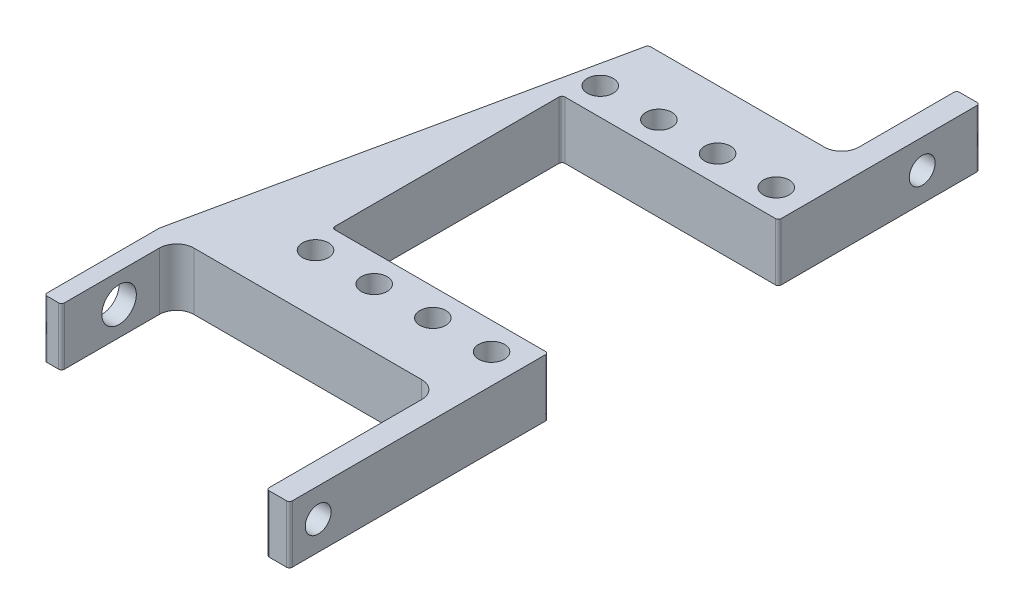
from build123d import *

# Parameters (mm, degrees)
BOSS_EXTRUDE1_DEPTH      = 10
SKETCH4_R                = 2.25
CUT_EXTRUDE2_DEPTH       = 26
LPATTERN2_COUNT          = 22
LPATTERN2_PITCH          = 10.2
SKETCH5_W                = 12
SKETCH5_H                = 10
BOSS_EXTRUDE2_DEPTH      = 30
SKETCH6_W                = 12
SKETCH6_H                = 10
BOSS_EXTRUDE3_DEPTH      = 20
SKETCH7_R                = 2.25
CUT_EXTRUDE3_DEPTH       = 20
SKETCH10_R               = 2.25
CUT_EXTRUDE4_DEPTH       = 20
MIRROR1_COPY_1_SKETCH_R  = 2.25
MIRROR1_COPY_1_DEPTH     = 26
MIRROR1_COPY_2_SKETCH_R  = 2.25
MIRROR1_COPY_2_DEPTH     = 26
MIRROR1_COPY_3_SKETCH_R  = 2.25
MIRROR1_COPY_3_DEPTH     = 26
MIRROR1_COPY_4_SKETCH_R  = 2.25
MIRROR1_COPY_4_DEPTH     = 26
MIRROR1_COPY_5_SKETCH_R  = 2.25
MIRROR1_COPY_5_DEPTH     = 26
MIRROR1_COPY_6_SKETCH_R  = 2.25
MIRROR1_COPY_6_DEPTH     = 26
MIRROR1_COPY_7_SKETCH_R  = 2.25
MIRROR1_COPY_7_DEPTH     = 26
MIRROR1_COPY_8_SKETCH_R  = 2.25
MIRROR1_COPY_8_DEPTH     = 26
MIRROR1_COPY_9_SKETCH_R  = 2.25
MIRROR1_COPY_9_DEPTH     = 26
MIRROR1_COPY_10_SKETCH_R = 2.25
MIRROR1_COPY_10_DEPTH    = 26
MIRROR1_COPY_11_SKETCH_R = 2.25
MIRROR1_COPY_11_DEPTH    = 26
MIRROR1_COPY_12_SKETCH_R = 2.25
MIRROR1_COPY_12_DEPTH    = 26
MIRROR1_COPY_13_SKETCH_R = 2.25
MIRROR1_COPY_13_DEPTH    = 26
MIRROR1_COPY_14_SKETCH_R = 2.25
MIRROR1_COPY_14_DEPTH    = 26
MIRROR1_COPY_15_SKETCH_R = 2.25
MIRROR1_COPY_15_DEPTH    = 26
MIRROR1_COPY_16_SKETCH_R = 2.25
MIRROR1_COPY_16_DEPTH    = 26
MIRROR1_COPY_17_SKETCH_R = 2.25
MIRROR1_COPY_17_DEPTH    = 26
MIRROR1_COPY_18_SKETCH_R = 2.25
MIRROR1_COPY_18_DEPTH    = 26
MIRROR1_COPY_19_SKETCH_R = 2.25
MIRROR1_COPY_19_DEPTH    = 26
MIRROR1_COPY_20_SKETCH_R = 2.25
MIRROR1_COPY_20_DEPTH    = 26
MIRROR1_COPY_21_SKETCH_R = 2.25
MIRROR1_COPY_21_DEPTH    = 26
SKETCH11_W               = 20
SKETCH11_H               = 10
CUT_EXTRUDE5_DEPTH       = 12
SKETCH12_R               = 3
CUT_EXTRUDE6_DEPTH       = 12
SKETCH13_W               = 20
SKETCH13_H               = 10
CUT_EXTRUDE7_DEPTH       = 8
SKETCH14_W               = 30
SKETCH14_H               = 10
CUT_EXTRUDE8_DEPTH       = 8
FILLET1_R                = 3
FILLET2_R                = 0.5


with BuildPart() as part:
    # Sketch2 → Boss-Extrude1 (new body)
    with BuildSketch(Plane(origin=(0, 0, 0), x_dir=(1, 0, 0), z_dir=(0, 1, 0))):
        Polygon((0, 0), (0, 20), (14.994375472, 90.002119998), (52.614375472, 90.002119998), (52.614375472, 75), (15, 75), (15, 35), (52.614375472, 35), (52.614375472, 20), (15, 20), (15, 0), align=None)
    extrude(amount=BOSS_EXTRUDE1_DEPTH)

    # Sketch4 → Cut-Extrude2 (cut)
    with BuildSketch(Plane(origin=(0, 10, 0), x_dir=(1, 0, 0), z_dir=(0, 1, 0))):
        with Locations(Location((16.9, 30.25, 0), (0, 0, 270))):
            Circle(SKETCH4_R)
    cut_extrude2 = extrude(amount=-CUT_EXTRUDE2_DEPTH, mode=Mode.SUBTRACT)

    # LPattern2: Cut-Extrude2 ×22
    with Locations(*[(i * LPATTERN2_PITCH, 0, 0) for i in range(1, LPATTERN2_COUNT)]):
        add(cut_extrude2, mode=Mode.SUBTRACT)

    # Sketch5 → Boss-Extrude2 (add)
    with BuildSketch(Plane.XY.offset(-20)):
        with Locations((46.614375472, 5)):
            Rectangle(SKETCH5_W, SKETCH5_H)
    extrude(amount=BOSS_EXTRUDE2_DEPTH)

    # Sketch6 → Boss-Extrude3 (add)
    with BuildSketch(Plane(origin=(0, 0, -90.002119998), x_dir=(-1, 0, 0), z_dir=(0, 0, -1))):
        with Locations((-46.614375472, 5)):
            Rectangle(SKETCH6_W, SKETCH6_H)
    extrude(amount=BOSS_EXTRUDE3_DEPTH)

    # Sketch7 → Cut-Extrude3 (cut)
    with BuildSketch(Plane.ZY.offset(-40.614375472)):
        with Locations((-100.002119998, 5)):
            Circle(SKETCH7_R)
    extrude(amount=-CUT_EXTRUDE3_DEPTH, mode=Mode.SUBTRACT)

    # Sketch10 → Cut-Extrude4 (cut)
    with BuildSketch(Plane.ZY.offset(-40.614375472)):
        with Locations((5, 5)):
            Circle(SKETCH10_R)
    extrude(amount=-CUT_EXTRUDE4_DEPTH, mode=Mode.SUBTRACT)

    # Mirror1: Cut-Extrude2 across plane
    add(cut_extrude2.mirror(Plane.XY.offset(-55)), mode=Mode.SUBTRACT)

    # Mirror1 copy 1 sketch → Mirror1 copy 1 (cut)
    with BuildSketch(Plane(origin=(10.2, 10, -110), x_dir=(1, 0, 0), z_dir=(0, 1, 0))):
        with Locations((16.9, -30.25)):
            Circle(MIRROR1_COPY_1_SKETCH_R)
    extrude(amount=-MIRROR1_COPY_1_DEPTH, mode=Mode.SUBTRACT)

    # Mirror1 copy 2 sketch → Mirror1 copy 2 (cut)
    with BuildSketch(Plane(origin=(20.4, 10, -110), x_dir=(1, 0, 0), z_dir=(0, 1, 0))):
        with Locations((16.9, -30.25)):
            Circle(MIRROR1_COPY_2_SKETCH_R)
    extrude(amount=-MIRROR1_COPY_2_DEPTH, mode=Mode.SUBTRACT)

    # Mirror1 copy 3 sketch → Mirror1 copy 3 (cut)
    with BuildSketch(Plane(origin=(30.6, 10, -110), x_dir=(1, 0, 0), z_dir=(0, 1, 0))):
        with Locations((16.9, -30.25)):
            Circle(MIRROR1_COPY_3_SKETCH_R)
    extrude(amount=-MIRROR1_COPY_3_DEPTH, mode=Mode.SUBTRACT)

    # Mirror1 copy 4 sketch → Mirror1 copy 4 (cut)
    with BuildSketch(Plane(origin=(40.8, 10, -110), x_dir=(1, 0, 0), z_dir=(0, 1, 0))):
        with Locations((16.9, -30.25)):
            Circle(MIRROR1_COPY_4_SKETCH_R)
    extrude(amount=-MIRROR1_COPY_4_DEPTH, mode=Mode.SUBTRACT)

    # Mirror1 copy 5 sketch → Mirror1 copy 5 (cut)
    with BuildSketch(Plane(origin=(51, 10, -110), x_dir=(1, 0, 0), z_dir=(0, 1, 0))):
        with Locations((16.9, -30.25)):
            Circle(MIRROR1_COPY_5_SKETCH_R)
    extrude(amount=-MIRROR1_COPY_5_DEPTH, mode=Mode.SUBTRACT)

    # Mirror1 copy 6 sketch → Mirror1 copy 6 (cut)
    with BuildSketch(Plane(origin=(61.2, 10, -110), x_dir=(1, 0, 0), z_dir=(0, 1, 0))):
        with Locations((16.9, -30.25)):
            Circle(MIRROR1_COPY_6_SKETCH_R)
    extrude(amount=-MIRROR1_COPY_6_DEPTH, mode=Mode.SUBTRACT)

    # Mirror1 copy 7 sketch → Mirror1 copy 7 (cut)
    with BuildSketch(Plane(origin=(71.4, 10, -110), x_dir=(1, 0, 0), z_dir=(0, 1, 0))):
        with Locations((16.9, -30.25)):
            Circle(MIRROR1_COPY_7_SKETCH_R)
    extrude(amount=-MIRROR1_COPY_7_DEPTH, mode=Mode.SUBTRACT)

    # Mirror1 copy 8 sketch → Mirror1 copy 8 (cut)
    with BuildSketch(Plane(origin=(81.6, 10, -110), x_dir=(1, 0, 0), z_dir=(0, 1, 0))):
        with Locations((16.9, -30.25)):
            Circle(MIRROR1_COPY_8_SKETCH_R)
    extrude(amount=-MIRROR1_COPY_8_DEPTH, mode=Mode.SUBTRACT)

    # Mirror1 copy 9 sketch → Mirror1 copy 9 (cut)
    with BuildSketch(Plane(origin=(91.8, 10, -110), x_dir=(1, 0, 0), z_dir=(0, 1, 0))):
        with Locations((16.9, -30.25)):
            Circle(MIRROR1_COPY_9_SKETCH_R)
    extrude(amount=-MIRROR1_COPY_9_DEPTH, mode=Mode.SUBTRACT)

    # Mirror1 copy 10 sketch → Mirror1 copy 10 (cut)
    with BuildSketch(Plane(origin=(102, 10, -110), x_dir=(1, 0, 0), z_dir=(0, 1, 0))):
        with Locations((16.9, -30.25)):
            Circle(MIRROR1_COPY_10_SKETCH_R)
    extrude(amount=-MIRROR1_COPY_10_DEPTH, mode=Mode.SUBTRACT)

    # Mirror1 copy 11 sketch → Mirror1 copy 11 (cut)
    with BuildSketch(Plane(origin=(112.2, 10, -110), x_dir=(1, 0, 0), z_dir=(0, 1, 0))):
        with Locations((16.9, -30.25)):
            Circle(MIRROR1_COPY_11_SKETCH_R)
    extrude(amount=-MIRROR1_COPY_11_DEPTH, mode=Mode.SUBTRACT)

    # Mirror1 copy 12 sketch → Mirror1 copy 12 (cut)
    with BuildSketch(Plane(origin=(122.4, 10, -110), x_dir=(1, 0, 0), z_dir=(0, 1, 0))):
        with Locations((16.9, -30.25)):
            Circle(MIRROR1_COPY_12_SKETCH_R)
    extrude(amount=-MIRROR1_COPY_12_DEPTH, mode=Mode.SUBTRACT)

    # Mirror1 copy 13 sketch → Mirror1 copy 13 (cut)
    with BuildSketch(Plane(origin=(132.6, 10, -110), x_dir=(1, 0, 0), z_dir=(0, 1, 0))):
        with Locations((16.9, -30.25)):
            Circle(MIRROR1_COPY_13_SKETCH_R)
    extrude(amount=-MIRROR1_COPY_13_DEPTH, mode=Mode.SUBTRACT)

    # Mirror1 copy 14 sketch → Mirror1 copy 14 (cut)
    with BuildSketch(Plane(origin=(142.8, 10, -110), x_dir=(1, 0, 0), z_dir=(0, 1, 0))):
        with Locations((16.9, -30.25)):
            Circle(MIRROR1_COPY_14_SKETCH_R)
    extrude(amount=-MIRROR1_COPY_14_DEPTH, mode=Mode.SUBTRACT)

    # Mirror1 copy 15 sketch → Mirror1 copy 15 (cut)
    with BuildSketch(Plane(origin=(153, 10, -110), x_dir=(1, 0, 0), z_dir=(0, 1, 0))):
        with Locations((16.9, -30.25)):
            Circle(MIRROR1_COPY_15_SKETCH_R)
    extrude(amount=-MIRROR1_COPY_15_DEPTH, mode=Mode.SUBTRACT)

    # Mirror1 copy 16 sketch → Mirror1 copy 16 (cut)
    with BuildSketch(Plane(origin=(163.2, 10, -110), x_dir=(1, 0, 0), z_dir=(0, 1, 0))):
        with Locations((16.9, -30.25)):
            Circle(MIRROR1_COPY_16_SKETCH_R)
    extrude(amount=-MIRROR1_COPY_16_DEPTH, mode=Mode.SUBTRACT)

    # Mirror1 copy 17 sketch → Mirror1 copy 17 (cut)
    with BuildSketch(Plane(origin=(173.4, 10, -110), x_dir=(1, 0, 0), z_dir=(0, 1, 0))):
        with Locations((16.9, -30.25)):
            Circle(MIRROR1_COPY_17_SKETCH_R)
    extrude(amount=-MIRROR1_COPY_17_DEPTH, mode=Mode.SUBTRACT)

    # Mirror1 copy 18 sketch → Mirror1 copy 18 (cut)
    with BuildSketch(Plane(origin=(183.6, 10, -110), x_dir=(1, 0, 0), z_dir=(0, 1, 0))):
        with Locations((16.9, -30.25)):
            Circle(MIRROR1_COPY_18_SKETCH_R)
    extrude(amount=-MIRROR1_COPY_18_DEPTH, mode=Mode.SUBTRACT)

    # Mirror1 copy 19 sketch → Mirror1 copy 19 (cut)
    with BuildSketch(Plane(origin=(193.8, 10, -110), x_dir=(1, 0, 0), z_dir=(0, 1, 0))):
        with Locations((16.9, -30.25)):
            Circle(MIRROR1_COPY_19_SKETCH_R)
    extrude(amount=-MIRROR1_COPY_19_DEPTH, mode=Mode.SUBTRACT)

    # Mirror1 copy 20 sketch → Mirror1 copy 20 (cut)
    with BuildSketch(Plane(origin=(204, 10, -110), x_dir=(1, 0, 0), z_dir=(0, 1, 0))):
        with Locations((16.9, -30.25)):
            Circle(MIRROR1_COPY_20_SKETCH_R)
    extrude(amount=-MIRROR1_COPY_20_DEPTH, mode=Mode.SUBTRACT)

    # Mirror1 copy 21 sketch → Mirror1 copy 21 (cut)
    with BuildSketch(Plane(origin=(214.2, 10, -110), x_dir=(1, 0, 0), z_dir=(0, 1, 0))):
        with Locations((16.9, -30.25)):
            Circle(MIRROR1_COPY_21_SKETCH_R)
    extrude(amount=-MIRROR1_COPY_21_DEPTH, mode=Mode.SUBTRACT)

    # Sketch11 → Cut-Extrude5 (cut)
    with BuildSketch(Plane(origin=(15, 0, 0), x_dir=(0, 0, -1), z_dir=(1, 0, 0))):
        with Locations((10, 5)):
            Rectangle(SKETCH11_W, SKETCH11_H)
    extrude(amount=-CUT_EXTRUDE5_DEPTH, mode=Mode.SUBTRACT)

    # Sketch12 → Cut-Extrude6 (cut)
    with BuildSketch(Plane(origin=(3, 0, 0), x_dir=(0, 0, -1), z_dir=(1, 0, 0))):
        with Locations((10, 5)):
            Circle(SKETCH12_R)
    extrude(amount=-CUT_EXTRUDE6_DEPTH, mode=Mode.SUBTRACT)

    # Sketch13 → Cut-Extrude7 (cut)
    with BuildSketch(Plane.ZY.offset(-40.614375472)):
        with Locations((-100.002119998, 5)):
            Rectangle(SKETCH13_W, SKETCH13_H)
    extrude(amount=-CUT_EXTRUDE7_DEPTH, mode=Mode.SUBTRACT)

    # Sketch14 → Cut-Extrude8 (cut)
    with BuildSketch(Plane.ZY.offset(-40.614375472)):
        with Locations((-5, 5)):
            Rectangle(SKETCH14_W, SKETCH14_H)
    extrude(amount=-CUT_EXTRUDE8_DEPTH, mode=Mode.SUBTRACT)

    # Fillet1
    fillet1_edges = [part.edges().sort_by_distance(p)[0] for p in [
        (3, 5, -20),
        (48.614375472, 5, -90.002119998),
        (48.614375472, 5, -20),
    ]]
    fillet(fillet1_edges, radius=FILLET1_R)

    # Fillet2
    fillet2_edges = [part.edges().sort_by_distance(p)[0] for p in [
        (3, 5, 0),
        (48.614375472, 5, -110.002119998),
        (0, 5, 0),
        (14.994375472, 5, -90.002119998),
        (52.614375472, 5, -75),
        (48.614375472, 5, 10),
        (15, 5, -75),
        (15, 5, -35),
        (52.614375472, 5, -35),
        (52.614375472, 5, 10),
        (52.614375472, 5, -110.002119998),
    ]]
    fillet(fillet2_edges, radius=FILLET2_R)


solid = part.part
